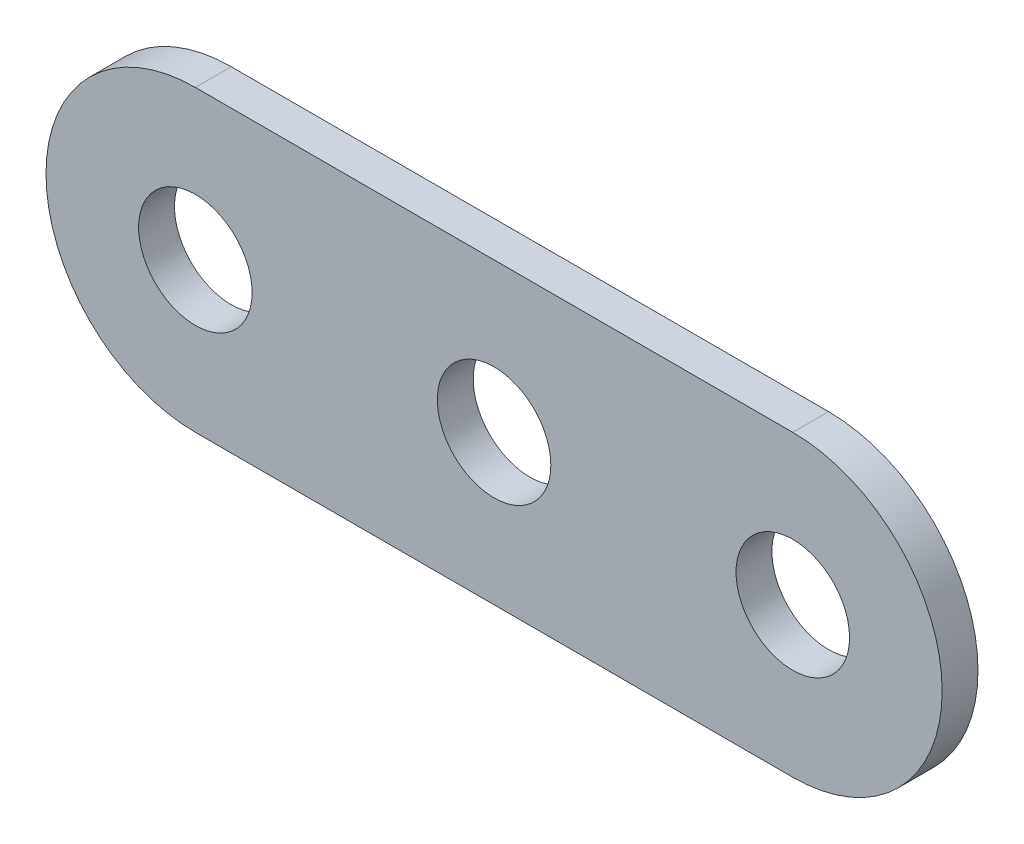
from build123d import *

# Parameters (mm, degrees)
BOSS_EXTRUDE1_DEPTH = 1.524
SKETCH2_R           = 2.413
CUT_EXTRUDE1_DEPTH  = 21.138211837
LPATTERN1_COUNT     = 3
LPATTERN1_PITCH     = 12.7


with BuildPart() as part:
    # Sketch1 → Boss-Extrude1 (new body)
    with BuildSketch(Plane.XY):
        with BuildLine():
            Line((-12.7, -6.35), (12.7, -6.35))
            ThreePointArc((12.7, -6.35), (19.05, 0), (12.7, 6.35))
            Line((12.7, 6.35), (-12.7, 6.35))
            ThreePointArc((-12.7, 6.35), (-19.05, 0), (-12.7, -6.35))
        make_face()
    extrude(amount=BOSS_EXTRUDE1_DEPTH)

    # Sketch2 → Cut-Extrude1 (cut, through all)
    with BuildSketch(Plane.XY.offset(1.524)):
        with Locations((-12.7, 0)):
            Circle(SKETCH2_R)
    cut_extrude1 = extrude(amount=-CUT_EXTRUDE1_DEPTH, mode=Mode.SUBTRACT)

    # LPattern1: Cut-Extrude1 ×3
    with Locations(*[(i * LPATTERN1_PITCH, 0, 0) for i in range(1, LPATTERN1_COUNT)]):
        add(cut_extrude1, mode=Mode.SUBTRACT)


solid = part.part
